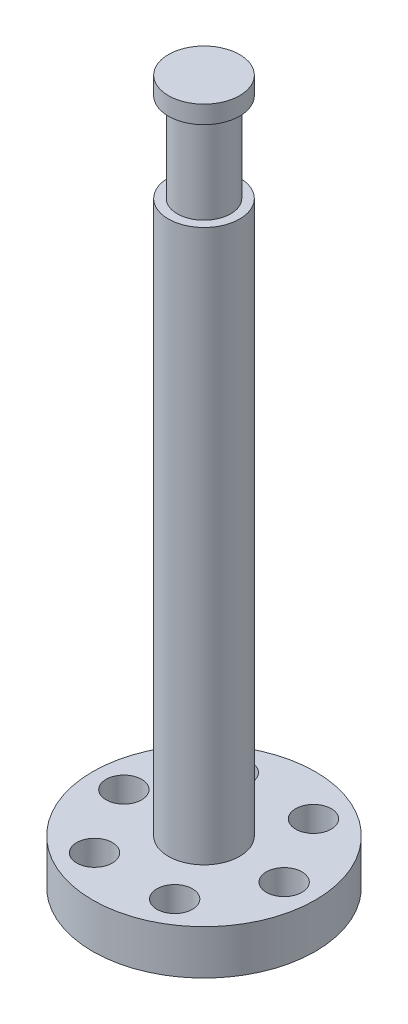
from build123d import *

# Parameters (mm, degrees)
SKETCH_1_R               = 12.5
EXTRUDE_1_DEPTH          = 79
SKETCH_2_OUTSIDE_W       = 44.31
SKETCH_2_OUTSIDE_H       = 44.31
SKETCH_2_OUTSIDE_R       = 4
CUT_EXTRUDE_2_DEPTH      = 72
SKETCH_4_OUTSIDE_W       = 44.31
SKETCH_4_OUTSIDE_H       = 44.31
SKETCH_4_OUTSIDE_R       = 4
CUT_EXTRUDE_3_DEPTH      = 80.003164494
SKETCH_6_OUTSIDE_W       = 44.31
SKETCH_6_OUTSIDE_H       = 44.31
SKETCH_6_OUTSIDE_R       = 3
CUT_EXTRUDE_4_DEPTH      = 10
SKETCH_7_R               = 2
CUT_EXTRUDE_5_DEPTH      = 81.953690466
PATTERN_CIRCULAR_1_COUNT = 6


with BuildPart() as part:
    # Sketch 1 → Extrude 1 (new body)
    with BuildSketch(Plane(origin=(0, 0, 0), x_dir=(1, 0, 0), z_dir=(0, 1, 0))):
        with Locations(Location((0, 0, 0), (0, 0, 270))):
            Circle(SKETCH_1_R)
    extrude(amount=EXTRUDE_1_DEPTH)

    # Sketch 2 outside → Cut-Extrude 2 (cut)
    with BuildSketch(Plane(origin=(0, 77, 0), x_dir=(1, 0, 0), z_dir=(0, 1, 0))):
        Rectangle(SKETCH_2_OUTSIDE_W, SKETCH_2_OUTSIDE_H)
        with Locations(Location((0, 0, 0), (0, 0, 270))):
            Circle(SKETCH_2_OUTSIDE_R, mode=Mode.SUBTRACT)
    extrude(amount=-CUT_EXTRUDE_2_DEPTH, mode=Mode.SUBTRACT)

    # Sketch 4 outside → Cut-Extrude 3 (cut, through all)
    with BuildSketch(Plane(origin=(0, 77, 0), x_dir=(1, 0, 0), z_dir=(0, 1, 0))):
        Rectangle(SKETCH_4_OUTSIDE_W, SKETCH_4_OUTSIDE_H)
        with Locations(Location((0, 0, 0), (0, 0, 270))):
            Circle(SKETCH_4_OUTSIDE_R, mode=Mode.SUBTRACT)
    extrude(amount=CUT_EXTRUDE_3_DEPTH, mode=Mode.SUBTRACT)

    # Sketch 6 outside → Cut-Extrude 4 (cut)
    with BuildSketch(Plane(origin=(0, 77, 0), x_dir=(1, 0, 0), z_dir=(0, 1, 0))):
        Rectangle(SKETCH_6_OUTSIDE_W, SKETCH_6_OUTSIDE_H)
        with Locations(Location((0, 0, 0), (0, 0, 270))):
            Circle(SKETCH_6_OUTSIDE_R, mode=Mode.SUBTRACT)
    extrude(amount=-CUT_EXTRUDE_4_DEPTH, mode=Mode.SUBTRACT)

    # Sketch 7 → Cut-Extrude 5 (cut, through all)
    with BuildSketch(Plane.XZ):
        with Locations(Location((9, 0, 0), (0, 0, 270))):
            Circle(SKETCH_7_R)
    cut_extrude_5 = extrude(amount=-CUT_EXTRUDE_5_DEPTH, mode=Mode.SUBTRACT)

    # Pattern Circular 1: Cut-Extrude 5 ×6 about axis
    pattern_circular_1_axis = Axis((0, 0, 0), (0, 1, 0))
    for i in range(1, PATTERN_CIRCULAR_1_COUNT):
        add(cut_extrude_5.rotate(pattern_circular_1_axis, i * 360 / PATTERN_CIRCULAR_1_COUNT), mode=Mode.SUBTRACT)


solid = part.part
